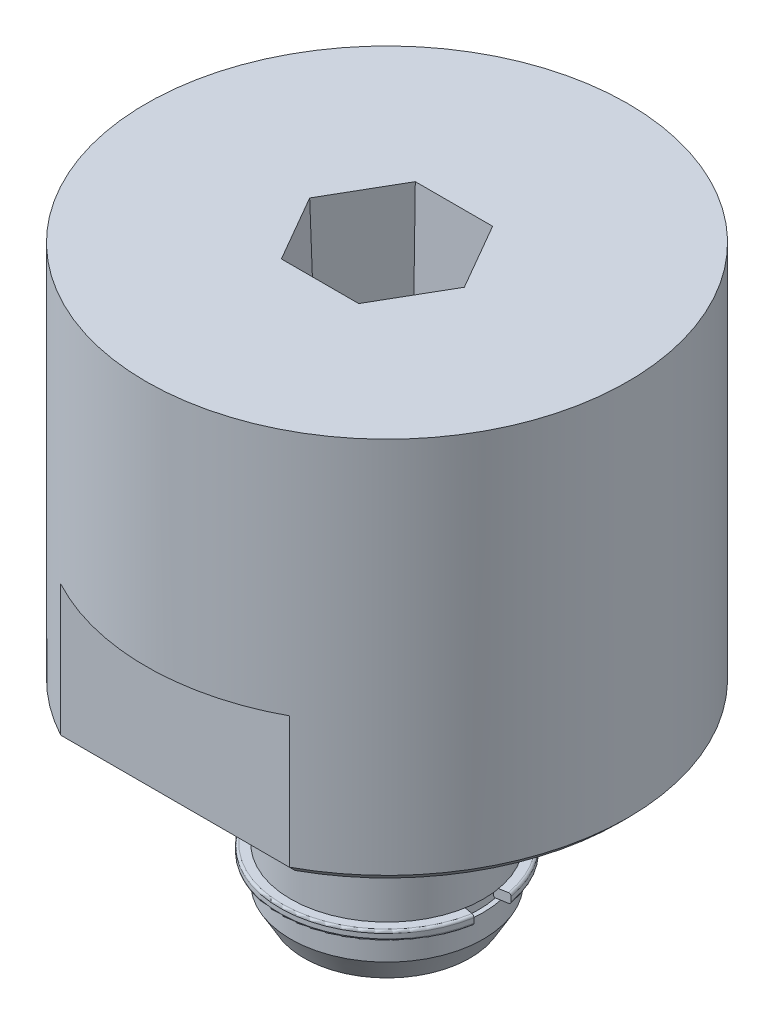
ISO-10303-21;
HEADER;
FILE_DESCRIPTION(('STEP AP214'),'2;1');
FILE_NAME('part.step','',(''),(''),'','','');
FILE_SCHEMA(('AUTOMOTIVE_DESIGN { 1 0 10303 214 1 1 1 1 }'));
ENDSEC;
DATA;
#1=APPLICATION_CONTEXT('core data for automotive mechanical design processes');
#2=APPLICATION_PROTOCOL_DEFINITION('international standard','automotive_design',2000,#1);
#3=PRODUCT_CONTEXT('',#1,'mechanical');
#4=PRODUCT('Part','Part','',(#3));
#5=PRODUCT_RELATED_PRODUCT_CATEGORY('part','',(#4));
#6=PRODUCT_DEFINITION_FORMATION('','',#4);
#7=PRODUCT_DEFINITION_CONTEXT('part definition',#1,'design');
#8=PRODUCT_DEFINITION('design','',#6,#7);
#9=PRODUCT_DEFINITION_SHAPE('','',#8);
#10=(LENGTH_UNIT() NAMED_UNIT(*) SI_UNIT(.MILLI.,.METRE.));
#11=(NAMED_UNIT(*) PLANE_ANGLE_UNIT() SI_UNIT($,.RADIAN.));
#12=(NAMED_UNIT(*) SI_UNIT($,.STERADIAN.) SOLID_ANGLE_UNIT());
#13=UNCERTAINTY_MEASURE_WITH_UNIT(LENGTH_MEASURE(1.E-05),#10,'distance_accuracy_value','');
#14=(GEOMETRIC_REPRESENTATION_CONTEXT(3) GLOBAL_UNCERTAINTY_ASSIGNED_CONTEXT((#13)) GLOBAL_UNIT_ASSIGNED_CONTEXT((#10,
#11,#12)) REPRESENTATION_CONTEXT('',''));
#15=CARTESIAN_POINT('',(0.,0.,0.));
#16=DIRECTION('',(0.,0.,1.));
#17=DIRECTION('',(1.,0.,0.));
#18=AXIS2_PLACEMENT_3D('',#15,#16,#17);
#19=CARTESIAN_POINT('',(0.,0.4826,0.));
#20=DIRECTION('',(0.,-1.,0.));
#21=DIRECTION('',(0.,0.,-1.));
#22=AXIS2_PLACEMENT_3D('',#19,#20,#21);
#23=CYLINDRICAL_SURFACE('',#22,3.0226);
#24=CARTESIAN_POINT('',(0.,1.6764,0.));
#25=DIRECTION('',(0.,-1.,0.));
#26=DIRECTION('',(0.984807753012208,0.,0.17364817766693));
#27=AXIS2_PLACEMENT_3D('',#24,#25,#26);
#28=CIRCLE('',#27,3.0226);
#29=CARTESIAN_POINT('',(2.9766799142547,1.6764,0.524868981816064));
#30=VERTEX_POINT('',#29);
#31=CARTESIAN_POINT('',(2.9766799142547,1.6764,-0.524868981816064));
#32=VERTEX_POINT('',#31);
#33=EDGE_CURVE('E125',#30,#32,#28,.T.);
#34=ORIENTED_EDGE('',*,*,#33,.T.);
#35=DIRECTION('',(0.,1.,0.));
#36=VECTOR('',#35,1.);
#37=CARTESIAN_POINT('',(2.9766799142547,1.6764,-0.524868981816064));
#38=LINE('',#37,#36);
#39=CARTESIAN_POINT('',(2.9766799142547,1.8288,-0.524868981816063));
#40=VERTEX_POINT('',#39);
#41=EDGE_CURVE('E116',#32,#40,#38,.T.);
#42=ORIENTED_EDGE('',*,*,#41,.T.);
#43=CARTESIAN_POINT('',(0.,1.8288,0.));
#44=DIRECTION('',(0.,-1.,0.));
#45=DIRECTION('',(0.984807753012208,0.,0.17364817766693));
#46=AXIS2_PLACEMENT_3D('',#43,#44,#45);
#47=CIRCLE('',#46,3.0226);
#48=CARTESIAN_POINT('',(2.9766799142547,1.8288,0.524868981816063));
#49=VERTEX_POINT('',#48);
#50=EDGE_CURVE('E124',#49,#40,#47,.T.);
#51=ORIENTED_EDGE('',*,*,#50,.F.);
#52=DIRECTION('',(0.,-1.,0.));
#53=VECTOR('',#52,1.);
#54=CARTESIAN_POINT('',(2.9766799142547,1.8288,0.524868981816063));
#55=LINE('',#54,#53);
#56=EDGE_CURVE('E137',#49,#30,#55,.T.);
#57=ORIENTED_EDGE('',*,*,#56,.T.);
#58=EDGE_LOOP('',(#34,#42,#51,#57));
#59=FACE_BOUND('',#58,.T.);
#60=ADVANCED_FACE('F54',(#59),#23,.F.);
#61=CARTESIAN_POINT('',(0.,1.67639999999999,0.));
#62=DIRECTION('',(0.,-1.,0.));
#63=DIRECTION('',(0.,0.,-1.));
#64=AXIS2_PLACEMENT_3D('',#61,#62,#63);
#65=TOROIDAL_SURFACE('',#64,3.0988,0.0761999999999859);
#66=CARTESIAN_POINT('',(0.,1.6002,0.));
#67=DIRECTION('',(0.,-1.,0.));
#68=DIRECTION('',(0.984807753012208,0.,0.173648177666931));
#69=AXIS2_PLACEMENT_3D('',#66,#67,#68);
#70=CIRCLE('',#69,3.0988);
#71=CARTESIAN_POINT('',(3.05172226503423,1.6002,0.538100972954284));
#72=VERTEX_POINT('',#71);
#73=CARTESIAN_POINT('',(3.05172226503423,1.6002,-0.538100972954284));
#74=VERTEX_POINT('',#73);
#75=EDGE_CURVE('E133',#72,#74,#70,.T.);
#76=ORIENTED_EDGE('',*,*,#75,.T.);
#77=CARTESIAN_POINT('',(3.05172226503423,1.67639999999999,-0.538100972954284));
#78=DIRECTION('',(-0.17364817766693,0.,-0.984807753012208));
#79=DIRECTION('',(0.,-1.,0.));
#80=AXIS2_PLACEMENT_3D('',#77,#78,#79);
#81=CIRCLE('',#80,0.0761999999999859);
#82=EDGE_CURVE('E118',#74,#32,#81,.T.);
#83=ORIENTED_EDGE('',*,*,#82,.T.);
#84=ORIENTED_EDGE('',*,*,#33,.F.);
#85=CARTESIAN_POINT('',(3.05172226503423,1.67639999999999,0.538100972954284));
#86=DIRECTION('',(-0.17364817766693,0.,0.984807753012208));
#87=DIRECTION('',(-0.984807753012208,0.,-0.17364817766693));
#88=AXIS2_PLACEMENT_3D('',#85,#86,#87);
#89=CIRCLE('',#88,0.0761999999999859);
#90=EDGE_CURVE('E134',#30,#72,#89,.T.);
#91=ORIENTED_EDGE('',*,*,#90,.T.);
#92=EDGE_LOOP('',(#76,#83,#84,#91));
#93=FACE_BOUND('',#92,.T.);
#94=ADVANCED_FACE('F130',(#93),#65,.T.);
#95=CARTESIAN_POINT('',(3.0988,1.6002,0.));
#96=DIRECTION('',(0.,-1.,0.));
#97=DIRECTION('',(0.,0.,-1.));
#98=AXIS2_PLACEMENT_3D('',#95,#96,#97);
#99=PLANE('',#98);
#100=CARTESIAN_POINT('',(0.,1.6002,0.));
#101=DIRECTION('',(0.,-1.,0.));
#102=DIRECTION('',(0.984807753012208,0.,0.17364817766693));
#103=AXIS2_PLACEMENT_3D('',#100,#101,#102);
#104=CIRCLE('',#103,3.45439999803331);
#105=CARTESIAN_POINT('',(3.40191990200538,1.6002,0.599850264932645));
#106=VERTEX_POINT('',#105);
#107=CARTESIAN_POINT('',(3.40191990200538,1.6002,-0.599850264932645));
#108=VERTEX_POINT('',#107);
#109=EDGE_CURVE('E156',#106,#108,#104,.T.);
#110=ORIENTED_EDGE('',*,*,#109,.T.);
#111=DIRECTION('',(-0.984807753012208,0.,0.17364817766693));
#112=VECTOR('',#111,1.);
#113=CARTESIAN_POINT('',(3.40191990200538,1.6002,-0.599850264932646));
#114=LINE('',#113,#112);
#115=EDGE_CURVE('E161',#108,#74,#114,.T.);
#116=ORIENTED_EDGE('',*,*,#115,.T.);
#117=ORIENTED_EDGE('',*,*,#75,.F.);
#118=DIRECTION('',(0.984807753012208,0.,0.17364817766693));
#119=VECTOR('',#118,1.);
#120=CARTESIAN_POINT('',(3.05172226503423,1.6002,0.538100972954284));
#121=LINE('',#120,#119);
#122=EDGE_CURVE('E165',#72,#106,#121,.T.);
#123=ORIENTED_EDGE('',*,*,#122,.T.);
#124=EDGE_LOOP('',(#110,#116,#117,#123));
#125=FACE_BOUND('',#124,.T.);
#126=ADVANCED_FACE('F248',(#125),#99,.T.);
#127=CARTESIAN_POINT('',(0.,1.67639999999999,0.));
#128=DIRECTION('',(0.,-1.,0.));
#129=DIRECTION('',(0.,0.,-1.));
#130=AXIS2_PLACEMENT_3D('',#127,#128,#129);
#131=TOROIDAL_SURFACE('',#130,3.4544,0.0761999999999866);
#132=CARTESIAN_POINT('',(0.,1.6764,0.));
#133=DIRECTION('',(0.,-1.,0.));
#134=DIRECTION('',(0.984807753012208,0.,0.17364817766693));
#135=AXIS2_PLACEMENT_3D('',#132,#133,#134);
#136=CIRCLE('',#135,3.5306);
#137=CARTESIAN_POINT('',(3.4769622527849,1.6764,0.613082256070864));
#138=VERTEX_POINT('',#137);
#139=CARTESIAN_POINT('',(3.4769622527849,1.6764,-0.613082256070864));
#140=VERTEX_POINT('',#139);
#141=EDGE_CURVE('E170',#138,#140,#136,.T.);
#142=ORIENTED_EDGE('',*,*,#141,.T.);
#143=CARTESIAN_POINT('',(3.40191990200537,1.67639999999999,-0.599850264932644));
#144=DIRECTION('',(-0.17364817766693,0.,-0.984807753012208));
#145=DIRECTION('',(0.984807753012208,0.,-0.17364817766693));
#146=AXIS2_PLACEMENT_3D('',#143,#144,#145);
#147=CIRCLE('',#146,0.0761999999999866);
#148=EDGE_CURVE('E175',#140,#108,#147,.T.);
#149=ORIENTED_EDGE('',*,*,#148,.T.);
#150=ORIENTED_EDGE('',*,*,#109,.F.);
#151=CARTESIAN_POINT('',(3.40191990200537,1.67639999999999,0.599850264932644));
#152=DIRECTION('',(-0.17364817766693,0.,0.984807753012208));
#153=DIRECTION('',(1.10880188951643E-13,-1.,0.));
#154=AXIS2_PLACEMENT_3D('',#151,#152,#153);
#155=CIRCLE('',#154,0.0761999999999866);
#156=EDGE_CURVE('E180',#106,#138,#155,.T.);
#157=ORIENTED_EDGE('',*,*,#156,.T.);
#158=EDGE_LOOP('',(#142,#149,#150,#157));
#159=FACE_BOUND('',#158,.T.);
#160=ADVANCED_FACE('F246',(#159),#131,.T.);
#161=CARTESIAN_POINT('',(0.,0.4826,0.));
#162=DIRECTION('',(0.,-1.,0.));
#163=DIRECTION('',(0.,0.,-1.));
#164=AXIS2_PLACEMENT_3D('',#161,#162,#163);
#165=CYLINDRICAL_SURFACE('',#164,3.5306);
#166=CARTESIAN_POINT('',(0.,1.8288,0.));
#167=DIRECTION('',(0.,-1.,0.));
#168=DIRECTION('',(0.984807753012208,0.,0.17364817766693));
#169=AXIS2_PLACEMENT_3D('',#166,#167,#168);
#170=CIRCLE('',#169,3.5306);
#171=CARTESIAN_POINT('',(3.4769622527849,1.8288,0.613082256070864));
#172=VERTEX_POINT('',#171);
#173=CARTESIAN_POINT('',(3.4769622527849,1.8288,-0.613082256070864));
#174=VERTEX_POINT('',#173);
#175=EDGE_CURVE('E185',#172,#174,#170,.T.);
#176=ORIENTED_EDGE('',*,*,#175,.T.);
#177=DIRECTION('',(0.,-1.,0.));
#178=VECTOR('',#177,1.);
#179=CARTESIAN_POINT('',(3.4769622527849,1.8288,-0.613082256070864));
#180=LINE('',#179,#178);
#181=EDGE_CURVE('E190',#174,#140,#180,.T.);
#182=ORIENTED_EDGE('',*,*,#181,.T.);
#183=ORIENTED_EDGE('',*,*,#141,.F.);
#184=DIRECTION('',(0.,1.,0.));
#185=VECTOR('',#184,1.);
#186=CARTESIAN_POINT('',(3.4769622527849,1.6764,0.613082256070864));
#187=LINE('',#186,#185);
#188=EDGE_CURVE('E195',#138,#172,#187,.T.);
#189=ORIENTED_EDGE('',*,*,#188,.T.);
#190=EDGE_LOOP('',(#176,#182,#183,#189));
#191=FACE_BOUND('',#190,.T.);
#192=ADVANCED_FACE('F242',(#191),#165,.T.);
#193=CARTESIAN_POINT('',(0.,1.82880000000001,0.));
#194=DIRECTION('',(0.,-1.,0.));
#195=DIRECTION('',(0.,0.,-1.));
#196=AXIS2_PLACEMENT_3D('',#193,#194,#195);
#197=TOROIDAL_SURFACE('',#196,3.4544,0.0761999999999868);
#198=CARTESIAN_POINT('',(0.,1.905,0.));
#199=DIRECTION('',(0.,-1.,0.));
#200=DIRECTION('',(0.984807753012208,0.,0.17364817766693));
#201=AXIS2_PLACEMENT_3D('',#198,#199,#200);
#202=CIRCLE('',#201,3.45439999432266);
#203=CARTESIAN_POINT('',(3.40191990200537,1.905,0.599850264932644));
#204=VERTEX_POINT('',#203);
#205=CARTESIAN_POINT('',(3.40191990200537,1.905,-0.599850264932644));
#206=VERTEX_POINT('',#205);
#207=EDGE_CURVE('E200',#204,#206,#202,.T.);
#208=ORIENTED_EDGE('',*,*,#207,.T.);
#209=CARTESIAN_POINT('',(3.40191990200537,1.82880000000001,-0.599850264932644));
#210=DIRECTION('',(-0.17364817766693,0.,-0.984807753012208));
#211=DIRECTION('',(0.,1.,0.));
#212=AXIS2_PLACEMENT_3D('',#209,#210,#211);
#213=CIRCLE('',#212,0.0761999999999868);
#214=EDGE_CURVE('E205',#206,#174,#213,.T.);
#215=ORIENTED_EDGE('',*,*,#214,.T.);
#216=ORIENTED_EDGE('',*,*,#175,.F.);
#217=CARTESIAN_POINT('',(3.40191990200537,1.82880000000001,0.599850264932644));
#218=DIRECTION('',(-0.17364817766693,0.,0.984807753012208));
#219=DIRECTION('',(0.984807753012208,-1.75931010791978E-13,0.17364817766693));
#220=AXIS2_PLACEMENT_3D('',#217,#218,#219);
#221=CIRCLE('',#220,0.0761999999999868);
#222=EDGE_CURVE('E210',#172,#204,#221,.T.);
#223=ORIENTED_EDGE('',*,*,#222,.T.);
#224=EDGE_LOOP('',(#208,#215,#216,#223));
#225=FACE_BOUND('',#224,.T.);
#226=ADVANCED_FACE('F240',(#225),#197,.T.);
#227=CARTESIAN_POINT('',(3.4544,1.905,0.));
#228=DIRECTION('',(0.,1.,0.));
#229=DIRECTION('',(0.,0.,1.));
#230=AXIS2_PLACEMENT_3D('',#227,#228,#229);
#231=PLANE('',#230);
#232=CARTESIAN_POINT('',(0.,1.905,0.));
#233=DIRECTION('',(0.,-1.,0.));
#234=DIRECTION('',(0.984807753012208,0.,0.17364817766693));
#235=AXIS2_PLACEMENT_3D('',#232,#233,#234);
#236=CIRCLE('',#235,3.09879999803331);
#237=CARTESIAN_POINT('',(3.05172226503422,1.905,0.538100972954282));
#238=VERTEX_POINT('',#237);
#239=CARTESIAN_POINT('',(3.05172226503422,1.905,-0.538100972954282));
#240=VERTEX_POINT('',#239);
#241=EDGE_CURVE('E215',#238,#240,#236,.T.);
#242=ORIENTED_EDGE('',*,*,#241,.T.);
#243=DIRECTION('',(0.984807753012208,0.,-0.173648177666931));
#244=VECTOR('',#243,1.);
#245=CARTESIAN_POINT('',(3.05172226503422,1.905,-0.538100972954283));
#246=LINE('',#245,#244);
#247=EDGE_CURVE('E76',#240,#206,#246,.T.);
#248=ORIENTED_EDGE('',*,*,#247,.T.);
#249=ORIENTED_EDGE('',*,*,#207,.F.);
#250=DIRECTION('',(-0.984807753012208,0.,-0.173648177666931));
#251=VECTOR('',#250,1.);
#252=CARTESIAN_POINT('',(3.40191990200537,1.905,0.599850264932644));
#253=LINE('',#252,#251);
#254=EDGE_CURVE('E223',#204,#238,#253,.T.);
#255=ORIENTED_EDGE('',*,*,#254,.T.);
#256=EDGE_LOOP('',(#242,#248,#249,#255));
#257=FACE_BOUND('',#256,.T.);
#258=ADVANCED_FACE('F235',(#257),#231,.T.);
#259=CARTESIAN_POINT('',(0.,1.82880000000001,0.));
#260=DIRECTION('',(0.,-1.,0.));
#261=DIRECTION('',(0.,0.,-1.));
#262=AXIS2_PLACEMENT_3D('',#259,#260,#261);
#263=TOROIDAL_SURFACE('',#262,3.0988,0.0761999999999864);
#264=ORIENTED_EDGE('',*,*,#50,.T.);
#265=CARTESIAN_POINT('',(3.05172226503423,1.82880000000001,-0.538100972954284));
#266=DIRECTION('',(-0.17364817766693,0.,-0.984807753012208));
#267=DIRECTION('',(-0.984807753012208,-1.78662858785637E-13,0.17364817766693));
#268=AXIS2_PLACEMENT_3D('',#265,#266,#267);
#269=CIRCLE('',#268,0.0761999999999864);
#270=EDGE_CURVE('E63',#40,#240,#269,.T.);
#271=ORIENTED_EDGE('',*,*,#270,.T.);
#272=ORIENTED_EDGE('',*,*,#241,.F.);
#273=CARTESIAN_POINT('',(3.05172226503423,1.82880000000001,0.538100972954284));
#274=DIRECTION('',(-0.17364817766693,0.,0.984807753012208));
#275=DIRECTION('',(0.,1.,0.));
#276=AXIS2_PLACEMENT_3D('',#273,#274,#275);
#277=CIRCLE('',#276,0.0761999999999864);
#278=EDGE_CURVE('E12',#238,#49,#277,.T.);
#279=ORIENTED_EDGE('',*,*,#278,.T.);
#280=EDGE_LOOP('',(#264,#271,#272,#279));
#281=FACE_BOUND('',#280,.T.);
#282=ADVANCED_FACE('F233',(#281),#263,.T.);
#283=CARTESIAN_POINT('',(0.,2.0574,0.));
#284=DIRECTION('',(0.17364817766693,0.,-0.984807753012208));
#285=DIRECTION('',(-0.984807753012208,0.,-0.17364817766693));
#286=AXIS2_PLACEMENT_3D('',#283,#284,#285);
#287=PLANE('',#286);
#288=ORIENTED_EDGE('',*,*,#278,.F.);
#289=ORIENTED_EDGE('',*,*,#254,.F.);
#290=ORIENTED_EDGE('',*,*,#222,.F.);
#291=ORIENTED_EDGE('',*,*,#188,.F.);
#292=ORIENTED_EDGE('',*,*,#156,.F.);
#293=ORIENTED_EDGE('',*,*,#122,.F.);
#294=ORIENTED_EDGE('',*,*,#90,.F.);
#295=ORIENTED_EDGE('',*,*,#56,.F.);
#296=EDGE_LOOP('',(#288,#289,#290,#291,#292,#293,#294,#295));
#297=FACE_BOUND('',#296,.T.);
#298=ADVANCED_FACE('F237',(#297),#287,.T.);
#299=CARTESIAN_POINT('',(3.54950319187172,2.0574,-0.6258731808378));
#300=DIRECTION('',(0.17364817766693,0.,0.984807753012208));
#301=DIRECTION('',(0.984807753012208,0.,-0.17364817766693));
#302=AXIS2_PLACEMENT_3D('',#299,#300,#301);
#303=PLANE('',#302);
#304=ORIENTED_EDGE('',*,*,#82,.F.);
#305=ORIENTED_EDGE('',*,*,#115,.F.);
#306=ORIENTED_EDGE('',*,*,#148,.F.);
#307=ORIENTED_EDGE('',*,*,#181,.F.);
#308=ORIENTED_EDGE('',*,*,#214,.F.);
#309=ORIENTED_EDGE('',*,*,#247,.F.);
#310=ORIENTED_EDGE('',*,*,#270,.F.);
#311=ORIENTED_EDGE('',*,*,#41,.F.);
#312=EDGE_LOOP('',(#304,#305,#306,#307,#308,#309,#310,#311));
#313=FACE_BOUND('',#312,.T.);
#314=ADVANCED_FACE('F56',(#313),#303,.T.);
#315=CLOSED_SHELL('',(#60,#94,#126,#160,#192,#226,#258,#282,#298,#314));
#316=MANIFOLD_SOLID_BREP('B2',#315);
#317=CARTESIAN_POINT('',(7.93496,19.05,0.));
#318=DIRECTION('',(0.,1.,0.));
#319=DIRECTION('',(0.,0.,1.));
#320=AXIS2_PLACEMENT_3D('',#317,#318,#319);
#321=PLANE('',#320);
#322=DIRECTION('',(0.5,0.,0.866025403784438));
#323=VECTOR('',#322,1.);
#324=CARTESIAN_POINT('',(3.89429759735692,19.05,2.33287752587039));
#325=LINE('',#324,#323);
#326=CARTESIAN_POINT('',(2.54741012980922,19.05,0.));
#327=VERTEX_POINT('',#326);
#328=CARTESIAN_POINT('',(1.27370506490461,19.05,-2.2061218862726));
#329=VERTEX_POINT('',#328);
#330=EDGE_CURVE('E515',#327,#329,#325,.F.);
#331=ORIENTED_EDGE('',*,*,#330,.F.);
#332=DIRECTION('',(-0.5,0.,0.866025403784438));
#333=VECTOR('',#332,1.);
#334=CARTESIAN_POINT('',(3.89429759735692,19.05,-2.33287752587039));
#335=LINE('',#334,#333);
#336=CARTESIAN_POINT('',(1.27370506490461,19.05,2.2061218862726));
#337=VERTEX_POINT('',#336);
#338=EDGE_CURVE('E426',#337,#327,#335,.F.);
#339=ORIENTED_EDGE('',*,*,#338,.F.);
#340=DIRECTION('',(-1.,0.,0.));
#341=VECTOR('',#340,1.);
#342=CARTESIAN_POINT('',(7.93496,19.05,2.2061218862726));
#343=LINE('',#342,#341);
#344=CARTESIAN_POINT('',(-1.27370506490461,19.05,2.2061218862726));
#345=VERTEX_POINT('',#344);
#346=EDGE_CURVE('E405',#345,#337,#343,.F.);
#347=ORIENTED_EDGE('',*,*,#346,.F.);
#348=DIRECTION('',(-0.5,0.,-0.866025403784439));
#349=VECTOR('',#348,1.);
#350=CARTESIAN_POINT('',(0.073182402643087,19.05,4.53899941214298));
#351=LINE('',#350,#349);
#352=CARTESIAN_POINT('',(-2.54741012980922,19.05,0.));
#353=VERTEX_POINT('',#352);
#354=EDGE_CURVE('E416',#353,#345,#351,.F.);
#355=ORIENTED_EDGE('',*,*,#354,.F.);
#356=DIRECTION('',(0.5,0.,-0.866025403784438));
#357=VECTOR('',#356,1.);
#358=CARTESIAN_POINT('',(0.0731824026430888,19.05,-4.53899941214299));
#359=LINE('',#358,#357);
#360=CARTESIAN_POINT('',(-1.27370506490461,19.05,-2.2061218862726));
#361=VERTEX_POINT('',#360);
#362=EDGE_CURVE('E422',#361,#353,#359,.F.);
#363=ORIENTED_EDGE('',*,*,#362,.F.);
#364=DIRECTION('',(1.,0.,0.));
#365=VECTOR('',#364,1.);
#366=CARTESIAN_POINT('',(7.93496,19.05,-2.2061218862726));
#367=LINE('',#366,#365);
#368=EDGE_CURVE('E513',#329,#361,#367,.F.);
#369=ORIENTED_EDGE('',*,*,#368,.F.);
#370=EDGE_LOOP('',(#331,#339,#347,#355,#363,#369));
#371=FACE_BOUND('',#370,.T.);
#372=CARTESIAN_POINT('',(0.,19.05,0.));
#373=DIRECTION('',(0.,-1.,0.));
#374=DIRECTION('',(0.,0.,-1.));
#375=AXIS2_PLACEMENT_3D('',#372,#373,#374);
#376=CIRCLE('',#375,7.93496);
#377=CARTESIAN_POINT('',(0.,19.05,-7.93496));
#378=VERTEX_POINT('',#377);
#379=EDGE_CURVE('E586',#378,#378,#376,.T.);
#380=ORIENTED_EDGE('',*,*,#379,.F.);
#381=EDGE_LOOP('',(#380));
#382=FACE_BOUND('',#381,.T.);
#383=ADVANCED_FACE('F350',(#371,#382),#321,.T.);
#384=CARTESIAN_POINT('',(0.,0.,0.));
#385=DIRECTION('',(0.,-1.,0.));
#386=DIRECTION('',(0.,0.,-1.));
#387=AXIS2_PLACEMENT_3D('',#384,#385,#386);
#388=CYLINDRICAL_SURFACE('',#387,7.93496);
#389=DIRECTION('',(0.,-1.,0.));
#390=VECTOR('',#389,1.);
#391=CARTESIAN_POINT('',(-3.76475300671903,10.922,-6.985));
#392=LINE('',#391,#390);
#393=CARTESIAN_POINT('',(-3.76475300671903,10.922,-6.985));
#394=VERTEX_POINT('',#393);
#395=CARTESIAN_POINT('',(-3.76475300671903,6.604,-6.985));
#396=VERTEX_POINT('',#395);
#397=EDGE_CURVE('E546',#394,#396,#392,.T.);
#398=ORIENTED_EDGE('',*,*,#397,.T.);
#399=CARTESIAN_POINT('',(0.,6.604,0.));
#400=DIRECTION('',(0.,-1.,0.));
#401=DIRECTION('',(0.,0.,-1.));
#402=AXIS2_PLACEMENT_3D('',#399,#400,#401);
#403=CIRCLE('',#402,7.93496);
#404=CARTESIAN_POINT('',(-3.76475300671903,6.604,6.985));
#405=VERTEX_POINT('',#404);
#406=EDGE_CURVE('E368',#396,#405,#403,.F.);
#407=ORIENTED_EDGE('',*,*,#406,.T.);
#408=DIRECTION('',(0.,-1.,0.));
#409=VECTOR('',#408,1.);
#410=CARTESIAN_POINT('',(-3.76475300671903,10.922,6.985));
#411=LINE('',#410,#409);
#412=CARTESIAN_POINT('',(-3.76475300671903,10.922,6.985));
#413=VERTEX_POINT('',#412);
#414=EDGE_CURVE('E549',#413,#405,#411,.T.);
#415=ORIENTED_EDGE('',*,*,#414,.F.);
#416=CARTESIAN_POINT('',(0.,10.922,0.));
#417=DIRECTION('',(0.,-1.,0.));
#418=DIRECTION('',(0.,0.,-1.));
#419=AXIS2_PLACEMENT_3D('',#416,#417,#418);
#420=CIRCLE('',#419,7.93496);
#421=CARTESIAN_POINT('',(3.76475300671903,10.922,6.985));
#422=VERTEX_POINT('',#421);
#423=EDGE_CURVE('E542',#422,#413,#420,.T.);
#424=ORIENTED_EDGE('',*,*,#423,.F.);
#425=DIRECTION('',(0.,-1.,0.));
#426=VECTOR('',#425,1.);
#427=CARTESIAN_POINT('',(3.76475300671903,10.922,6.985));
#428=LINE('',#427,#426);
#429=CARTESIAN_POINT('',(3.76475300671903,6.604,6.985));
#430=VERTEX_POINT('',#429);
#431=EDGE_CURVE('E550',#422,#430,#428,.T.);
#432=ORIENTED_EDGE('',*,*,#431,.T.);
#433=CARTESIAN_POINT('',(0.,6.604,0.));
#434=DIRECTION('',(0.,-1.,0.));
#435=DIRECTION('',(0.,0.,-1.));
#436=AXIS2_PLACEMENT_3D('',#433,#434,#435);
#437=CIRCLE('',#436,7.93496);
#438=CARTESIAN_POINT('',(3.76475300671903,6.604,-6.985));
#439=VERTEX_POINT('',#438);
#440=EDGE_CURVE('E440',#430,#439,#437,.F.);
#441=ORIENTED_EDGE('',*,*,#440,.T.);
#442=DIRECTION('',(0.,-1.,0.));
#443=VECTOR('',#442,1.);
#444=CARTESIAN_POINT('',(3.76475300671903,10.922,-6.985));
#445=LINE('',#444,#443);
#446=CARTESIAN_POINT('',(3.76475300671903,10.922,-6.985));
#447=VERTEX_POINT('',#446);
#448=EDGE_CURVE('E559',#447,#439,#445,.T.);
#449=ORIENTED_EDGE('',*,*,#448,.F.);
#450=CARTESIAN_POINT('',(0.,10.922,0.));
#451=DIRECTION('',(0.,-1.,0.));
#452=DIRECTION('',(0.,0.,-1.));
#453=AXIS2_PLACEMENT_3D('',#450,#451,#452);
#454=CIRCLE('',#453,7.93496);
#455=EDGE_CURVE('E510',#394,#447,#454,.T.);
#456=ORIENTED_EDGE('',*,*,#455,.F.);
#457=EDGE_LOOP('',(#398,#407,#415,#424,#432,#441,#449,#456));
#458=FACE_BOUND('',#457,.T.);
#459=ORIENTED_EDGE('',*,*,#379,.T.);
#460=EDGE_LOOP('',(#459));
#461=FACE_BOUND('',#460,.T.);
#462=ADVANCED_FACE('F607',(#458,#461),#388,.T.);
#463=CARTESIAN_POINT('',(3.683,6.35,0.));
#464=DIRECTION('',(0.,-1.,0.));
#465=DIRECTION('',(0.,0.,-1.));
#466=AXIS2_PLACEMENT_3D('',#463,#464,#465);
#467=PLANE('',#466);
#468=CARTESIAN_POINT('',(0.,6.35,0.));
#469=DIRECTION('',(0.,-1.,0.));
#470=DIRECTION('',(0.,0.,-1.));
#471=AXIS2_PLACEMENT_3D('',#468,#469,#470);
#472=CIRCLE('',#471,7.68096);
#473=CARTESIAN_POINT('',(-3.70010615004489,6.35,6.731));
#474=VERTEX_POINT('',#473);
#475=CARTESIAN_POINT('',(-3.70010615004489,6.35,-6.731));
#476=VERTEX_POINT('',#475);
#477=EDGE_CURVE('E598',#474,#476,#472,.T.);
#478=ORIENTED_EDGE('',*,*,#477,.T.);
#479=DIRECTION('',(1.,0.,0.));
#480=VECTOR('',#479,1.);
#481=CARTESIAN_POINT('',(3.76475300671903,6.35,-6.731));
#482=LINE('',#481,#480);
#483=CARTESIAN_POINT('',(3.70010615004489,6.35,-6.731));
#484=VERTEX_POINT('',#483);
#485=EDGE_CURVE('E601',#476,#484,#482,.T.);
#486=ORIENTED_EDGE('',*,*,#485,.T.);
#487=CARTESIAN_POINT('',(0.,6.35,0.));
#488=DIRECTION('',(0.,-1.,0.));
#489=DIRECTION('',(0.,0.,-1.));
#490=AXIS2_PLACEMENT_3D('',#487,#488,#489);
#491=CIRCLE('',#490,7.68096);
#492=CARTESIAN_POINT('',(3.70010615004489,6.35,6.731));
#493=VERTEX_POINT('',#492);
#494=EDGE_CURVE('E592',#484,#493,#491,.T.);
#495=ORIENTED_EDGE('',*,*,#494,.T.);
#496=DIRECTION('',(-1.,0.,0.));
#497=VECTOR('',#496,1.);
#498=CARTESIAN_POINT('',(-3.76475300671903,6.35,6.731));
#499=LINE('',#498,#497);
#500=EDGE_CURVE('E595',#493,#474,#499,.T.);
#501=ORIENTED_EDGE('',*,*,#500,.T.);
#502=EDGE_LOOP('',(#478,#486,#495,#501));
#503=FACE_BOUND('',#502,.T.);
#504=CARTESIAN_POINT('',(0.,6.35,-5.715));
#505=DIRECTION('',(0.,-1.,0.));
#506=DIRECTION('',(-0.707106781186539,0.,-0.707106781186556));
#507=AXIS2_PLACEMENT_3D('',#504,#505,#506);
#508=CIRCLE('',#507,0.567961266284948);
#509=CARTESIAN_POINT('',(-0.40160926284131,6.35,-6.11660926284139));
#510=VERTEX_POINT('',#509);
#511=EDGE_CURVE('E494',#510,#510,#508,.T.);
#512=ORIENTED_EDGE('',*,*,#511,.F.);
#513=EDGE_LOOP('',(#512));
#514=FACE_BOUND('',#513,.T.);
#515=CARTESIAN_POINT('',(-4.04111525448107,6.35,-4.04111525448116));
#516=DIRECTION('',(0.,-1.,0.));
#517=DIRECTION('',(-1.,0.,0.));
#518=AXIS2_PLACEMENT_3D('',#515,#516,#517);
#519=CIRCLE('',#518,0.567961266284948);
#520=CARTESIAN_POINT('',(-4.60907652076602,6.35,-4.04111525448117));
#521=VERTEX_POINT('',#520);
#522=EDGE_CURVE('E776',#521,#521,#519,.T.);
#523=ORIENTED_EDGE('',*,*,#522,.F.);
#524=EDGE_LOOP('',(#523));
#525=FACE_BOUND('',#524,.T.);
#526=CARTESIAN_POINT('',(-5.715,6.35,0.));
#527=DIRECTION('',(0.,-1.,0.));
#528=DIRECTION('',(-0.707106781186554,0.,0.707106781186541));
#529=AXIS2_PLACEMENT_3D('',#526,#527,#528);
#530=CIRCLE('',#529,0.567961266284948);
#531=CARTESIAN_POINT('',(-6.11660926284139,6.35,0.401609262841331));
#532=VERTEX_POINT('',#531);
#533=EDGE_CURVE('E779',#532,#532,#530,.T.);
#534=ORIENTED_EDGE('',*,*,#533,.F.);
#535=EDGE_LOOP('',(#534));
#536=FACE_BOUND('',#535,.T.);
#537=CARTESIAN_POINT('',(-4.04111525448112,6.35,4.04111525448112));
#538=DIRECTION('',(0.,-1.,0.));
#539=DIRECTION('',(0.,0.,1.));
#540=AXIS2_PLACEMENT_3D('',#537,#538,#539);
#541=CIRCLE('',#540,0.567961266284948);
#542=CARTESIAN_POINT('',(-4.04111525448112,6.35,4.60907652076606));
#543=VERTEX_POINT('',#542);
#544=EDGE_CURVE('E782',#543,#543,#541,.T.);
#545=ORIENTED_EDGE('',*,*,#544,.F.);
#546=EDGE_LOOP('',(#545));
#547=FACE_BOUND('',#546,.T.);
#548=CARTESIAN_POINT('',(0.,6.35,5.715));
#549=DIRECTION('',(0.,-1.,0.));
#550=DIRECTION('',(0.707106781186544,0.,0.707106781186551));
#551=AXIS2_PLACEMENT_3D('',#548,#549,#550);
#552=CIRCLE('',#551,0.567961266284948);
#553=CARTESIAN_POINT('',(0.401609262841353,6.35,6.11660926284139));
#554=VERTEX_POINT('',#553);
#555=EDGE_CURVE('E785',#554,#554,#552,.T.);
#556=ORIENTED_EDGE('',*,*,#555,.F.);
#557=EDGE_LOOP('',(#556));
#558=FACE_BOUND('',#557,.T.);
#559=CARTESIAN_POINT('',(4.0411152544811,6.35,4.04111525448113));
#560=DIRECTION('',(0.,-1.,0.));
#561=DIRECTION('',(1.,0.,0.));
#562=AXIS2_PLACEMENT_3D('',#559,#560,#561);
#563=CIRCLE('',#562,0.567961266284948);
#564=CARTESIAN_POINT('',(4.60907652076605,6.35,4.04111525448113));
#565=VERTEX_POINT('',#564);
#566=EDGE_CURVE('E525',#565,#565,#563,.T.);
#567=ORIENTED_EDGE('',*,*,#566,.F.);
#568=EDGE_LOOP('',(#567));
#569=FACE_BOUND('',#568,.T.);
#570=CARTESIAN_POINT('',(5.715,6.35,0.));
#571=DIRECTION('',(0.,-1.,0.));
#572=DIRECTION('',(0.707106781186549,0.,-0.707106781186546));
#573=AXIS2_PLACEMENT_3D('',#570,#571,#572);
#574=CIRCLE('',#573,0.567961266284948);
#575=CARTESIAN_POINT('',(6.11660926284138,6.35,-0.401609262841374));
#576=VERTEX_POINT('',#575);
#577=EDGE_CURVE('E520',#576,#576,#574,.T.);
#578=ORIENTED_EDGE('',*,*,#577,.F.);
#579=EDGE_LOOP('',(#578));
#580=FACE_BOUND('',#579,.T.);
#581=CARTESIAN_POINT('',(4.04111525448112,6.35,-4.04111525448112));
#582=DIRECTION('',(0.,-1.,0.));
#583=DIRECTION('',(0.,0.,-1.));
#584=AXIS2_PLACEMENT_3D('',#581,#582,#583);
#585=CIRCLE('',#584,0.567961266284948);
#586=CARTESIAN_POINT('',(4.04111525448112,6.35,-4.60907652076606));
#587=VERTEX_POINT('',#586);
#588=EDGE_CURVE('E516',#587,#587,#585,.T.);
#589=ORIENTED_EDGE('',*,*,#588,.F.);
#590=EDGE_LOOP('',(#589));
#591=FACE_BOUND('',#590,.T.);
#592=CARTESIAN_POINT('',(0.,6.35,0.));
#593=DIRECTION('',(0.,-1.,0.));
#594=DIRECTION('',(0.,0.,-1.));
#595=AXIS2_PLACEMENT_3D('',#592,#593,#594);
#596=CIRCLE('',#595,3.683);
#597=CARTESIAN_POINT('',(0.,6.35,-3.683));
#598=VERTEX_POINT('',#597);
#599=EDGE_CURVE('E583',#598,#598,#596,.T.);
#600=ORIENTED_EDGE('',*,*,#599,.F.);
#601=EDGE_LOOP('',(#600));
#602=FACE_BOUND('',#601,.T.);
#603=ADVANCED_FACE('F679',(#503,#514,#525,#536,#547,#558,#569,#580,#591,#602),#467,.T.);
#604=CARTESIAN_POINT('',(0.,5.842,0.));
#605=DIRECTION('',(0.,-1.,0.));
#606=DIRECTION('',(0.,0.,-1.));
#607=AXIS2_PLACEMENT_3D('',#604,#605,#606);
#608=TOROIDAL_SURFACE('',#607,3.683,0.508);
#609=ORIENTED_EDGE('',*,*,#599,.T.);
#610=EDGE_LOOP('',(#609));
#611=FACE_BOUND('',#610,.T.);
#612=CARTESIAN_POINT('',(0.,5.842,0.));
#613=DIRECTION('',(0.,-1.,0.));
#614=DIRECTION('',(0.,0.,-1.));
#615=AXIS2_PLACEMENT_3D('',#612,#613,#614);
#616=CIRCLE('',#615,3.175);
#617=CARTESIAN_POINT('',(0.,5.842,-3.175));
#618=VERTEX_POINT('',#617);
#619=EDGE_CURVE('E580',#618,#618,#616,.T.);
#620=ORIENTED_EDGE('',*,*,#619,.F.);
#621=EDGE_LOOP('',(#620));
#622=FACE_BOUND('',#621,.T.);
#623=ADVANCED_FACE('F684',(#611,#622),#608,.F.);
#624=CARTESIAN_POINT('',(0.,0.,0.));
#625=DIRECTION('',(0.,-1.,0.));
#626=DIRECTION('',(0.,0.,-1.));
#627=AXIS2_PLACEMENT_3D('',#624,#625,#626);
#628=CYLINDRICAL_SURFACE('',#627,3.175);
#629=ORIENTED_EDGE('',*,*,#619,.T.);
#630=EDGE_LOOP('',(#629));
#631=FACE_BOUND('',#630,.T.);
#632=CARTESIAN_POINT('',(0.,1.905,0.));
#633=DIRECTION('',(0.,-1.,0.));
#634=DIRECTION('',(0.,0.,-1.));
#635=AXIS2_PLACEMENT_3D('',#632,#633,#634);
#636=CIRCLE('',#635,3.175);
#637=CARTESIAN_POINT('',(0.,1.905,-3.175));
#638=VERTEX_POINT('',#637);
#639=EDGE_CURVE('E577',#638,#638,#636,.T.);
#640=ORIENTED_EDGE('',*,*,#639,.F.);
#641=EDGE_LOOP('',(#640));
#642=FACE_BOUND('',#641,.T.);
#643=ADVANCED_FACE('F687',(#631,#642),#628,.T.);
#644=CARTESIAN_POINT('',(3.175,1.905,0.));
#645=DIRECTION('',(0.,-1.,0.));
#646=DIRECTION('',(0.,0.,-1.));
#647=AXIS2_PLACEMENT_3D('',#644,#645,#646);
#648=PLANE('',#647);
#649=ORIENTED_EDGE('',*,*,#639,.T.);
#650=EDGE_LOOP('',(#649));
#651=FACE_BOUND('',#650,.T.);
#652=CARTESIAN_POINT('',(0.,1.905,0.));
#653=DIRECTION('',(0.,-1.,0.));
#654=DIRECTION('',(0.,0.,-1.));
#655=AXIS2_PLACEMENT_3D('',#652,#653,#654);
#656=CIRCLE('',#655,3.0226);
#657=CARTESIAN_POINT('',(0.,1.905,-3.0226));
#658=VERTEX_POINT('',#657);
#659=EDGE_CURVE('E574',#658,#658,#656,.T.);
#660=ORIENTED_EDGE('',*,*,#659,.F.);
#661=EDGE_LOOP('',(#660));
#662=FACE_BOUND('',#661,.T.);
#663=ADVANCED_FACE('F691',(#651,#662),#648,.T.);
#664=CARTESIAN_POINT('',(0.,0.,0.));
#665=DIRECTION('',(0.,-1.,0.));
#666=DIRECTION('',(0.,0.,-1.));
#667=AXIS2_PLACEMENT_3D('',#664,#665,#666);
#668=CYLINDRICAL_SURFACE('',#667,3.0226);
#669=ORIENTED_EDGE('',*,*,#659,.T.);
#670=EDGE_LOOP('',(#669));
#671=FACE_BOUND('',#670,.T.);
#672=CARTESIAN_POINT('',(0.,1.524,0.));
#673=DIRECTION('',(0.,-1.,0.));
#674=DIRECTION('',(0.,0.,-1.));
#675=AXIS2_PLACEMENT_3D('',#672,#673,#674);
#676=CIRCLE('',#675,3.0226);
#677=CARTESIAN_POINT('',(0.,1.524,-3.0226));
#678=VERTEX_POINT('',#677);
#679=EDGE_CURVE('E571',#678,#678,#676,.T.);
#680=ORIENTED_EDGE('',*,*,#679,.F.);
#681=EDGE_LOOP('',(#680));
#682=FACE_BOUND('',#681,.T.);
#683=ADVANCED_FACE('F695',(#671,#682),#668,.T.);
#684=CARTESIAN_POINT('',(3.0226,1.524,0.));
#685=DIRECTION('',(0.,1.,0.));
#686=DIRECTION('',(0.,0.,1.));
#687=AXIS2_PLACEMENT_3D('',#684,#685,#686);
#688=PLANE('',#687);
#689=ORIENTED_EDGE('',*,*,#679,.T.);
#690=EDGE_LOOP('',(#689));
#691=FACE_BOUND('',#690,.T.);
#692=CARTESIAN_POINT('',(0.,1.524,0.));
#693=DIRECTION('',(0.,-1.,0.));
#694=DIRECTION('',(0.,0.,-1.));
#695=AXIS2_PLACEMENT_3D('',#692,#693,#694);
#696=CIRCLE('',#695,3.175);
#697=CARTESIAN_POINT('',(0.,1.524,-3.175));
#698=VERTEX_POINT('',#697);
#699=EDGE_CURVE('E568',#698,#698,#696,.T.);
#700=ORIENTED_EDGE('',*,*,#699,.F.);
#701=EDGE_LOOP('',(#700));
#702=FACE_BOUND('',#701,.T.);
#703=ADVANCED_FACE('F699',(#691,#702),#688,.T.);
#704=CARTESIAN_POINT('',(0.,0.,0.));
#705=DIRECTION('',(0.,-1.,0.));
#706=DIRECTION('',(0.,0.,-1.));
#707=AXIS2_PLACEMENT_3D('',#704,#705,#706);
#708=CYLINDRICAL_SURFACE('',#707,3.175);
#709=ORIENTED_EDGE('',*,*,#699,.T.);
#710=EDGE_LOOP('',(#709));
#711=FACE_BOUND('',#710,.T.);
#712=CARTESIAN_POINT('',(0.,0.762,0.));
#713=DIRECTION('',(0.,-1.,0.));
#714=DIRECTION('',(0.,0.,-1.));
#715=AXIS2_PLACEMENT_3D('',#712,#713,#714);
#716=CIRCLE('',#715,3.175);
#717=CARTESIAN_POINT('',(0.,0.762,-3.175));
#718=VERTEX_POINT('',#717);
#719=EDGE_CURVE('E565',#718,#718,#716,.T.);
#720=ORIENTED_EDGE('',*,*,#719,.F.);
#721=EDGE_LOOP('',(#720));
#722=FACE_BOUND('',#721,.T.);
#723=ADVANCED_FACE('F703',(#711,#722),#708,.T.);
#724=CARTESIAN_POINT('',(0.,0.,0.));
#725=DIRECTION('',(0.,1.,0.));
#726=DIRECTION('',(0.,0.,1.));
#727=AXIS2_PLACEMENT_3D('',#724,#725,#726);
#728=CONICAL_SURFACE('',#727,2.73505909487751,0.523598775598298);
#729=ORIENTED_EDGE('',*,*,#719,.T.);
#730=EDGE_LOOP('',(#729));
#731=FACE_BOUND('',#730,.T.);
#732=CARTESIAN_POINT('',(0.,0.,0.));
#733=DIRECTION('',(0.,-1.,0.));
#734=DIRECTION('',(0.,0.,-1.));
#735=AXIS2_PLACEMENT_3D('',#732,#733,#734);
#736=CIRCLE('',#735,2.73505909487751);
#737=CARTESIAN_POINT('',(0.,0.,-2.73505909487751));
#738=VERTEX_POINT('',#737);
#739=EDGE_CURVE('E552',#738,#738,#736,.T.);
#740=ORIENTED_EDGE('',*,*,#739,.F.);
#741=EDGE_LOOP('',(#740));
#742=FACE_BOUND('',#741,.T.);
#743=ADVANCED_FACE('F707',(#731,#742),#728,.T.);
#744=CARTESIAN_POINT('',(0.,0.,0.));
#745=DIRECTION('',(0.,-1.,0.));
#746=DIRECTION('',(0.,0.,-1.));
#747=AXIS2_PLACEMENT_3D('',#744,#745,#746);
#748=PLANE('',#747);
#749=CARTESIAN_POINT('',(0.,0.,0.));
#750=DIRECTION('',(0.,-1.,0.));
#751=DIRECTION('',(0.,0.,-1.));
#752=AXIS2_PLACEMENT_3D('',#749,#750,#751);
#753=CIRCLE('',#752,2.0955);
#754=CARTESIAN_POINT('',(0.,0.,-2.0955));
#755=VERTEX_POINT('',#754);
#756=EDGE_CURVE('E360',#755,#755,#753,.F.);
#757=ORIENTED_EDGE('',*,*,#756,.T.);
#758=EDGE_LOOP('',(#757));
#759=FACE_BOUND('',#758,.T.);
#760=ORIENTED_EDGE('',*,*,#739,.T.);
#761=EDGE_LOOP('',(#760));
#762=FACE_BOUND('',#761,.T.);
#763=ADVANCED_FACE('F711',(#759,#762),#748,.T.);
#764=CARTESIAN_POINT('',(-3.76475300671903,10.922,-6.985));
#765=DIRECTION('',(0.,0.,1.));
#766=DIRECTION('',(1.,0.,0.));
#767=AXIS2_PLACEMENT_3D('',#764,#765,#766);
#768=PLANE('',#767);
#769=ORIENTED_EDGE('',*,*,#448,.T.);
#770=DIRECTION('',(-1.,0.,0.));
#771=VECTOR('',#770,1.);
#772=CARTESIAN_POINT('',(-3.76475300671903,6.604,-6.985));
#773=LINE('',#772,#771);
#774=EDGE_CURVE('E589',#439,#396,#773,.T.);
#775=ORIENTED_EDGE('',*,*,#774,.T.);
#776=ORIENTED_EDGE('',*,*,#397,.F.);
#777=DIRECTION('',(-1.,0.,0.));
#778=VECTOR('',#777,1.);
#779=CARTESIAN_POINT('',(-3.76475300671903,10.922,-6.985));
#780=LINE('',#779,#778);
#781=EDGE_CURVE('E556',#447,#394,#780,.T.);
#782=ORIENTED_EDGE('',*,*,#781,.F.);
#783=EDGE_LOOP('',(#769,#775,#776,#782));
#784=FACE_BOUND('',#783,.T.);
#785=ADVANCED_FACE('F618',(#784),#768,.F.);
#786=CARTESIAN_POINT('',(0.,10.922,0.));
#787=DIRECTION('',(0.,-1.,0.));
#788=DIRECTION('',(0.,0.,-1.));
#789=AXIS2_PLACEMENT_3D('',#786,#787,#788);
#790=PLANE('',#789);
#791=ORIENTED_EDGE('',*,*,#455,.T.);
#792=ORIENTED_EDGE('',*,*,#781,.T.);
#793=EDGE_LOOP('',(#791,#792));
#794=FACE_BOUND('',#793,.T.);
#795=ADVANCED_FACE('F717',(#794),#790,.T.);
#796=CARTESIAN_POINT('',(-3.76475300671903,10.922,6.985));
#797=DIRECTION('',(0.,0.,-1.));
#798=DIRECTION('',(-1.,0.,0.));
#799=AXIS2_PLACEMENT_3D('',#796,#797,#798);
#800=PLANE('',#799);
#801=ORIENTED_EDGE('',*,*,#414,.T.);
#802=DIRECTION('',(1.,0.,0.));
#803=VECTOR('',#802,1.);
#804=CARTESIAN_POINT('',(3.76475300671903,6.604,6.985));
#805=LINE('',#804,#803);
#806=EDGE_CURVE('E432',#405,#430,#805,.T.);
#807=ORIENTED_EDGE('',*,*,#806,.T.);
#808=ORIENTED_EDGE('',*,*,#431,.F.);
#809=DIRECTION('',(1.,0.,0.));
#810=VECTOR('',#809,1.);
#811=CARTESIAN_POINT('',(-3.76475300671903,10.922,6.985));
#812=LINE('',#811,#810);
#813=EDGE_CURVE('E545',#413,#422,#812,.T.);
#814=ORIENTED_EDGE('',*,*,#813,.F.);
#815=EDGE_LOOP('',(#801,#807,#808,#814));
#816=FACE_BOUND('',#815,.T.);
#817=ADVANCED_FACE('F720',(#816),#800,.F.);
#818=CARTESIAN_POINT('',(0.,10.922,0.));
#819=DIRECTION('',(0.,-1.,0.));
#820=DIRECTION('',(0.,0.,-1.));
#821=AXIS2_PLACEMENT_3D('',#818,#819,#820);
#822=PLANE('',#821);
#823=ORIENTED_EDGE('',*,*,#423,.T.);
#824=ORIENTED_EDGE('',*,*,#813,.T.);
#825=EDGE_LOOP('',(#823,#824));
#826=FACE_BOUND('',#825,.T.);
#827=ADVANCED_FACE('F724',(#826),#822,.T.);
#828=CARTESIAN_POINT('',(2.29135888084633,12.7,0.));
#829=DIRECTION('',(-0.865497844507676,0.034899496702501,0.499695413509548));
#830=DIRECTION('',(0.5,0.,0.866025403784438));
#831=AXIS2_PLACEMENT_3D('',#828,#829,#830);
#832=PLANE('',#831);
#833=ORIENTED_EDGE('',*,*,#330,.T.);
#834=DIRECTION('',(0.0201451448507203,0.999188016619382,-0.0348924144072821));
#835=VECTOR('',#834,1.);
#836=CARTESIAN_POINT('',(1.144749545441,12.6538777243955,-1.98276437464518));
#837=LINE('',#836,#835);
#838=CARTESIAN_POINT('',(1.14567944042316,12.7,-1.984375));
#839=VERTEX_POINT('',#838);
#840=EDGE_CURVE('E504',#839,#329,#837,.T.);
#841=ORIENTED_EDGE('',*,*,#840,.F.);
#842=DIRECTION('',(-0.5,0.,-0.866025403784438));
#843=VECTOR('',#842,1.);
#844=CARTESIAN_POINT('',(2.29135888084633,12.7,0.));
#845=LINE('',#844,#843);
#846=CARTESIAN_POINT('',(2.29135888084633,12.7,0.));
#847=VERTEX_POINT('',#846);
#848=EDGE_CURVE('E428',#847,#839,#845,.T.);
#849=ORIENTED_EDGE('',*,*,#848,.F.);
#850=DIRECTION('',(0.0402902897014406,0.999188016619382,0.));
#851=VECTOR('',#850,1.);
#852=CARTESIAN_POINT('',(2.28949909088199,12.6538777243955,0.));
#853=LINE('',#852,#851);
#854=EDGE_CURVE('E508',#847,#327,#853,.T.);
#855=ORIENTED_EDGE('',*,*,#854,.T.);
#856=EDGE_LOOP('',(#833,#841,#849,#855));
#857=FACE_BOUND('',#856,.T.);
#858=ADVANCED_FACE('F658',(#857),#832,.T.);
#859=CARTESIAN_POINT('',(1.14567944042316,12.7,1.984375));
#860=DIRECTION('',(-0.865497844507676,0.034899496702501,-0.499695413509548));
#861=DIRECTION('',(-0.5,0.,0.866025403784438));
#862=AXIS2_PLACEMENT_3D('',#859,#860,#861);
#863=PLANE('',#862);
#864=ORIENTED_EDGE('',*,*,#338,.T.);
#865=ORIENTED_EDGE('',*,*,#854,.F.);
#866=DIRECTION('',(0.5,0.,-0.866025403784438));
#867=VECTOR('',#866,1.);
#868=CARTESIAN_POINT('',(1.14567944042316,12.7,1.984375));
#869=LINE('',#868,#867);
#870=CARTESIAN_POINT('',(1.14567944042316,12.7,1.984375));
#871=VERTEX_POINT('',#870);
#872=EDGE_CURVE('E507',#871,#847,#869,.T.);
#873=ORIENTED_EDGE('',*,*,#872,.F.);
#874=DIRECTION('',(0.0201451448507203,0.999188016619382,0.0348924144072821));
#875=VECTOR('',#874,1.);
#876=CARTESIAN_POINT('',(1.144749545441,12.6538777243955,1.98276437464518));
#877=LINE('',#876,#875);
#878=EDGE_CURVE('E395',#871,#337,#877,.T.);
#879=ORIENTED_EDGE('',*,*,#878,.T.);
#880=EDGE_LOOP('',(#864,#865,#873,#879));
#881=FACE_BOUND('',#880,.T.);
#882=ADVANCED_FACE('F665',(#881),#863,.T.);
#883=CARTESIAN_POINT('',(-1.14567944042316,12.7,1.984375));
#884=DIRECTION('',(0.,0.034899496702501,-0.999390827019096));
#885=DIRECTION('',(0.,0.999390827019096,0.034899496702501));
#886=AXIS2_PLACEMENT_3D('',#883,#884,#885);
#887=PLANE('',#886);
#888=ORIENTED_EDGE('',*,*,#346,.T.);
#889=ORIENTED_EDGE('',*,*,#878,.F.);
#890=DIRECTION('',(1.,0.,0.));
#891=VECTOR('',#890,1.);
#892=CARTESIAN_POINT('',(-1.14567944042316,12.7,1.984375));
#893=LINE('',#892,#891);
#894=CARTESIAN_POINT('',(-1.14567944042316,12.7,1.984375));
#895=VERTEX_POINT('',#894);
#896=EDGE_CURVE('E409',#895,#871,#893,.T.);
#897=ORIENTED_EDGE('',*,*,#896,.F.);
#898=DIRECTION('',(-0.0201451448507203,0.999188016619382,0.0348924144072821));
#899=VECTOR('',#898,1.);
#900=CARTESIAN_POINT('',(-1.14474954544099,12.6538777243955,1.98276437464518));
#901=LINE('',#900,#899);
#902=EDGE_CURVE('E401',#895,#345,#901,.T.);
#903=ORIENTED_EDGE('',*,*,#902,.T.);
#904=EDGE_LOOP('',(#888,#889,#897,#903));
#905=FACE_BOUND('',#904,.T.);
#906=ADVANCED_FACE('F403',(#905),#887,.T.);
#907=CARTESIAN_POINT('',(-2.29135888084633,12.7,0.));
#908=DIRECTION('',(0.865497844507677,0.034899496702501,-0.499695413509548));
#909=DIRECTION('',(-0.5,0.,-0.866025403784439));
#910=AXIS2_PLACEMENT_3D('',#907,#908,#909);
#911=PLANE('',#910);
#912=ORIENTED_EDGE('',*,*,#354,.T.);
#913=ORIENTED_EDGE('',*,*,#902,.F.);
#914=DIRECTION('',(0.5,0.,0.866025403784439));
#915=VECTOR('',#914,1.);
#916=CARTESIAN_POINT('',(-2.29135888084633,12.7,0.));
#917=LINE('',#916,#915);
#918=CARTESIAN_POINT('',(-2.29135888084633,12.7,0.));
#919=VERTEX_POINT('',#918);
#920=EDGE_CURVE('E537',#919,#895,#917,.T.);
#921=ORIENTED_EDGE('',*,*,#920,.F.);
#922=DIRECTION('',(-0.0402902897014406,0.999188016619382,0.));
#923=VECTOR('',#922,1.);
#924=CARTESIAN_POINT('',(-2.28949909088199,12.6538777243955,0.));
#925=LINE('',#924,#923);
#926=EDGE_CURVE('E413',#919,#353,#925,.T.);
#927=ORIENTED_EDGE('',*,*,#926,.T.);
#928=EDGE_LOOP('',(#912,#913,#921,#927));
#929=FACE_BOUND('',#928,.T.);
#930=ADVANCED_FACE('F417',(#929),#911,.T.);
#931=CARTESIAN_POINT('',(-1.14567944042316,12.7,-1.984375));
#932=DIRECTION('',(0.865497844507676,0.034899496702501,0.499695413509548));
#933=DIRECTION('',(0.5,0.,-0.866025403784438));
#934=AXIS2_PLACEMENT_3D('',#931,#932,#933);
#935=PLANE('',#934);
#936=ORIENTED_EDGE('',*,*,#362,.T.);
#937=ORIENTED_EDGE('',*,*,#926,.F.);
#938=DIRECTION('',(-0.5,0.,0.866025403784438));
#939=VECTOR('',#938,1.);
#940=CARTESIAN_POINT('',(-1.14567944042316,12.7,-1.984375));
#941=LINE('',#940,#939);
#942=CARTESIAN_POINT('',(-1.14567944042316,12.7,-1.984375));
#943=VERTEX_POINT('',#942);
#944=EDGE_CURVE('E534',#943,#919,#941,.T.);
#945=ORIENTED_EDGE('',*,*,#944,.F.);
#946=DIRECTION('',(-0.0201451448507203,0.999188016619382,-0.0348924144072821));
#947=VECTOR('',#946,1.);
#948=CARTESIAN_POINT('',(-1.144749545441,12.6538777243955,-1.98276437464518));
#949=LINE('',#948,#947);
#950=EDGE_CURVE('E502',#943,#361,#949,.T.);
#951=ORIENTED_EDGE('',*,*,#950,.T.);
#952=EDGE_LOOP('',(#936,#937,#945,#951));
#953=FACE_BOUND('',#952,.T.);
#954=ADVANCED_FACE('F667',(#953),#935,.T.);
#955=CARTESIAN_POINT('',(1.14567944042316,12.7,-1.984375));
#956=DIRECTION('',(0.,0.034899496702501,0.999390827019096));
#957=DIRECTION('',(0.,-0.999390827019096,0.034899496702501));
#958=AXIS2_PLACEMENT_3D('',#955,#956,#957);
#959=PLANE('',#958);
#960=ORIENTED_EDGE('',*,*,#368,.T.);
#961=ORIENTED_EDGE('',*,*,#950,.F.);
#962=DIRECTION('',(-1.,0.,0.));
#963=VECTOR('',#962,1.);
#964=CARTESIAN_POINT('',(1.14567944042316,12.7,-1.984375));
#965=LINE('',#964,#963);
#966=EDGE_CURVE('E531',#839,#943,#965,.T.);
#967=ORIENTED_EDGE('',*,*,#966,.F.);
#968=ORIENTED_EDGE('',*,*,#840,.T.);
#969=EDGE_LOOP('',(#960,#961,#967,#968));
#970=FACE_BOUND('',#969,.T.);
#971=ADVANCED_FACE('F661',(#970),#959,.T.);
#972=CARTESIAN_POINT('',(0.,12.7,0.));
#973=DIRECTION('',(0.,1.,0.));
#974=DIRECTION('',(0.,0.,1.));
#975=AXIS2_PLACEMENT_3D('',#972,#973,#974);
#976=PLANE('',#975);
#977=CARTESIAN_POINT('',(0.,12.7,0.));
#978=DIRECTION('',(0.,1.,0.));
#979=DIRECTION('',(0.,0.,1.));
#980=AXIS2_PLACEMENT_3D('',#977,#978,#979);
#981=CIRCLE('',#980,1.5875);
#982=CARTESIAN_POINT('',(0.,12.7,1.5875));
#983=VERTEX_POINT('',#982);
#984=EDGE_CURVE('E454',#983,#983,#981,.T.);
#985=ORIENTED_EDGE('',*,*,#984,.F.);
#986=EDGE_LOOP('',(#985));
#987=FACE_BOUND('',#986,.T.);
#988=ORIENTED_EDGE('',*,*,#848,.T.);
#989=ORIENTED_EDGE('',*,*,#966,.T.);
#990=ORIENTED_EDGE('',*,*,#944,.T.);
#991=ORIENTED_EDGE('',*,*,#920,.T.);
#992=ORIENTED_EDGE('',*,*,#896,.T.);
#993=ORIENTED_EDGE('',*,*,#872,.T.);
#994=EDGE_LOOP('',(#988,#989,#990,#991,#992,#993));
#995=FACE_BOUND('',#994,.T.);
#996=ADVANCED_FACE('F664',(#987,#995),#976,.T.);
#997=CARTESIAN_POINT('',(4.04111525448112,5.842,-4.04111525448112));
#998=DIRECTION('',(0.,-1.,0.));
#999=DIRECTION('',(0.707106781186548,0.,-0.707106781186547));
#1000=AXIS2_PLACEMENT_3D('',#997,#998,#999);
#1001=SPHERICAL_SURFACE('',#1000,0.762);
#1002=ORIENTED_EDGE('',*,*,#588,.T.);
#1003=EDGE_LOOP('',(#1002));
#1004=FACE_BOUND('',#1003,.T.);
#1005=ADVANCED_FACE('F730',(#1004),#1001,.F.);
#1006=CARTESIAN_POINT('',(5.715,5.842,0.));
#1007=DIRECTION('',(0.,-1.,0.));
#1008=DIRECTION('',(1.,0.,0.));
#1009=AXIS2_PLACEMENT_3D('',#1006,#1007,#1008);
#1010=SPHERICAL_SURFACE('',#1009,0.762);
#1011=ORIENTED_EDGE('',*,*,#577,.T.);
#1012=EDGE_LOOP('',(#1011));
#1013=FACE_BOUND('',#1012,.T.);
#1014=ADVANCED_FACE('F734',(#1013),#1010,.F.);
#1015=CARTESIAN_POINT('',(4.0411152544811,5.842,4.04111525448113));
#1016=DIRECTION('',(0.,-1.,0.));
#1017=DIRECTION('',(0.707106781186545,0.,0.70710678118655));
#1018=AXIS2_PLACEMENT_3D('',#1015,#1016,#1017);
#1019=SPHERICAL_SURFACE('',#1018,0.762);
#1020=ORIENTED_EDGE('',*,*,#566,.T.);
#1021=EDGE_LOOP('',(#1020));
#1022=FACE_BOUND('',#1021,.T.);
#1023=ADVANCED_FACE('F737',(#1022),#1019,.F.);
#1024=CARTESIAN_POINT('',(0.,5.842,5.715));
#1025=DIRECTION('',(0.,-1.,0.));
#1026=DIRECTION('',(0.,0.,1.));
#1027=AXIS2_PLACEMENT_3D('',#1024,#1025,#1026);
#1028=SPHERICAL_SURFACE('',#1027,0.762);
#1029=ORIENTED_EDGE('',*,*,#555,.T.);
#1030=EDGE_LOOP('',(#1029));
#1031=FACE_BOUND('',#1030,.T.);
#1032=ADVANCED_FACE('F741',(#1031),#1028,.F.);
#1033=CARTESIAN_POINT('',(-4.04111525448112,5.842,4.04111525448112));
#1034=DIRECTION('',(0.,-1.,0.));
#1035=DIRECTION('',(-0.707106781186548,0.,0.707106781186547));
#1036=AXIS2_PLACEMENT_3D('',#1033,#1034,#1035);
#1037=SPHERICAL_SURFACE('',#1036,0.762);
#1038=ORIENTED_EDGE('',*,*,#544,.T.);
#1039=EDGE_LOOP('',(#1038));
#1040=FACE_BOUND('',#1039,.T.);
#1041=ADVANCED_FACE('F745',(#1040),#1037,.F.);
#1042=CARTESIAN_POINT('',(-5.715,5.842,0.));
#1043=DIRECTION('',(0.,-1.,0.));
#1044=DIRECTION('',(-1.,0.,0.));
#1045=AXIS2_PLACEMENT_3D('',#1042,#1043,#1044);
#1046=SPHERICAL_SURFACE('',#1045,0.762);
#1047=ORIENTED_EDGE('',*,*,#533,.T.);
#1048=EDGE_LOOP('',(#1047));
#1049=FACE_BOUND('',#1048,.T.);
#1050=ADVANCED_FACE('F749',(#1049),#1046,.F.);
#1051=CARTESIAN_POINT('',(-4.04111525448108,5.842,-4.04111525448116));
#1052=DIRECTION('',(0.,-1.,0.));
#1053=DIRECTION('',(-0.70710678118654,0.,-0.707106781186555));
#1054=AXIS2_PLACEMENT_3D('',#1051,#1052,#1053);
#1055=SPHERICAL_SURFACE('',#1054,0.762);
#1056=ORIENTED_EDGE('',*,*,#522,.T.);
#1057=EDGE_LOOP('',(#1056));
#1058=FACE_BOUND('',#1057,.T.);
#1059=ADVANCED_FACE('F753',(#1058),#1055,.F.);
#1060=CARTESIAN_POINT('',(0.,5.842,-5.715));
#1061=DIRECTION('',(0.,-1.,0.));
#1062=DIRECTION('',(0.,0.,-1.));
#1063=AXIS2_PLACEMENT_3D('',#1060,#1061,#1062);
#1064=SPHERICAL_SURFACE('',#1063,0.762);
#1065=ORIENTED_EDGE('',*,*,#511,.T.);
#1066=EDGE_LOOP('',(#1065));
#1067=FACE_BOUND('',#1066,.T.);
#1068=ADVANCED_FACE('F757',(#1067),#1064,.F.);
#1069=CARTESIAN_POINT('',(-3.76475300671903,6.604,6.985));
#1070=DIRECTION('',(0.,-0.707106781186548,0.707106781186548));
#1071=DIRECTION('',(-1.,0.,0.));
#1072=AXIS2_PLACEMENT_3D('',#1069,#1070,#1071);
#1073=PLANE('',#1072);
#1074=CARTESIAN_POINT('',(-3.76475300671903,6.604,6.985));
#1075=CARTESIAN_POINT('',(-3.75406891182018,6.56165516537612,6.94265516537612));
#1076=CARTESIAN_POINT('',(-3.74333962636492,6.51931608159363,6.90031608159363));
#1077=CARTESIAN_POINT('',(-3.72179067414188,6.43464941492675,6.81564941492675));
#1078=CARTESIAN_POINT('',(-3.71097100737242,6.39232183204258,6.77332183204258));
#1079=CARTESIAN_POINT('',(-3.70010615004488,6.35,6.731));
#1080=B_SPLINE_CURVE_WITH_KNOTS('',3,(#1074,#1075,#1076,#1077,#1078,#1079),.UNSPECIFIED.,.F.,
.F.,(4,2,4),(0.,0.182490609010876,0.364981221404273),.UNSPECIFIED.);
#1081=EDGE_CURVE('E495',#474,#405,#1080,.F.);
#1082=ORIENTED_EDGE('',*,*,#1081,.F.);
#1083=ORIENTED_EDGE('',*,*,#500,.F.);
#1084=CARTESIAN_POINT('',(3.76475300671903,6.604,6.985));
#1085=CARTESIAN_POINT('',(3.75406891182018,6.56165516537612,6.94265516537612));
#1086=CARTESIAN_POINT('',(3.74333962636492,6.51931608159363,6.90031608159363));
#1087=CARTESIAN_POINT('',(3.72179067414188,6.43464941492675,6.81564941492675));
#1088=CARTESIAN_POINT('',(3.71097100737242,6.39232183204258,6.77332183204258));
#1089=CARTESIAN_POINT('',(3.70010615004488,6.35,6.731));
#1090=B_SPLINE_CURVE_WITH_KNOTS('',3,(#1084,#1085,#1086,#1087,#1088,#1089),.UNSPECIFIED.,.F.,
.F.,(4,2,4),(0.,0.182490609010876,0.364981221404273),.UNSPECIFIED.);
#1091=EDGE_CURVE('E488',#430,#493,#1090,.T.);
#1092=ORIENTED_EDGE('',*,*,#1091,.F.);
#1093=ORIENTED_EDGE('',*,*,#806,.F.);
#1094=EDGE_LOOP('',(#1082,#1083,#1092,#1093));
#1095=FACE_BOUND('',#1094,.T.);
#1096=ADVANCED_FACE('F482',(#1095),#1073,.T.);
#1097=CARTESIAN_POINT('',(0.,6.35,0.));
#1098=DIRECTION('',(0.,1.,0.));
#1099=DIRECTION('',(0.,0.,1.));
#1100=AXIS2_PLACEMENT_3D('',#1097,#1098,#1099);
#1101=CONICAL_SURFACE('',#1100,7.68096,0.785398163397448);
#1102=ORIENTED_EDGE('',*,*,#1091,.T.);
#1103=ORIENTED_EDGE('',*,*,#494,.F.);
#1104=CARTESIAN_POINT('',(3.70010615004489,6.35,-6.731));
#1105=CARTESIAN_POINT('',(3.71097100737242,6.39232183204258,-6.77332183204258));
#1106=CARTESIAN_POINT('',(3.72179067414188,6.43464941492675,-6.81564941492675));
#1107=CARTESIAN_POINT('',(3.74333962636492,6.51931608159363,-6.90031608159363));
#1108=CARTESIAN_POINT('',(3.75406891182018,6.56165516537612,-6.94265516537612));
#1109=CARTESIAN_POINT('',(3.76475300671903,6.604,-6.985));
#1110=B_SPLINE_CURVE_WITH_KNOTS('',3,(#1104,#1105,#1106,#1107,#1108,#1109),.UNSPECIFIED.,.F.,
.F.,(4,2,4),(0.,0.182490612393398,0.364981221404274),.UNSPECIFIED.);
#1111=EDGE_CURVE('E453',#439,#484,#1110,.F.);
#1112=ORIENTED_EDGE('',*,*,#1111,.F.);
#1113=ORIENTED_EDGE('',*,*,#440,.F.);
#1114=EDGE_LOOP('',(#1102,#1103,#1112,#1113));
#1115=FACE_BOUND('',#1114,.T.);
#1116=ADVANCED_FACE('F474',(#1115),#1101,.T.);
#1117=CARTESIAN_POINT('',(0.,6.35,0.));
#1118=DIRECTION('',(0.,1.,0.));
#1119=DIRECTION('',(0.,0.,1.));
#1120=AXIS2_PLACEMENT_3D('',#1117,#1118,#1119);
#1121=CONICAL_SURFACE('',#1120,7.68096,0.785398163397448);
#1122=ORIENTED_EDGE('',*,*,#1081,.T.);
#1123=ORIENTED_EDGE('',*,*,#406,.F.);
#1124=CARTESIAN_POINT('',(-3.76475300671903,6.604,-6.985));
#1125=CARTESIAN_POINT('',(-3.75406891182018,6.56165516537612,-6.94265516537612));
#1126=CARTESIAN_POINT('',(-3.74333962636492,6.51931608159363,-6.90031608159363));
#1127=CARTESIAN_POINT('',(-3.72179067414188,6.43464941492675,-6.81564941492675));
#1128=CARTESIAN_POINT('',(-3.71097100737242,6.39232183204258,-6.77332183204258));
#1129=CARTESIAN_POINT('',(-3.70010615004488,6.35,-6.731));
#1130=B_SPLINE_CURVE_WITH_KNOTS('',3,(#1124,#1125,#1126,#1127,#1128,#1129),.UNSPECIFIED.,.F.,
.F.,(4,2,4),(0.,0.182490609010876,0.364981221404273),.UNSPECIFIED.);
#1131=EDGE_CURVE('E444',#476,#396,#1130,.F.);
#1132=ORIENTED_EDGE('',*,*,#1131,.F.);
#1133=ORIENTED_EDGE('',*,*,#477,.F.);
#1134=EDGE_LOOP('',(#1122,#1123,#1132,#1133));
#1135=FACE_BOUND('',#1134,.T.);
#1136=ADVANCED_FACE('F462',(#1135),#1121,.T.);
#1137=CARTESIAN_POINT('',(-3.76475300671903,6.604,-6.985));
#1138=DIRECTION('',(0.,-0.707106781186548,-0.707106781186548));
#1139=DIRECTION('',(1.,0.,0.));
#1140=AXIS2_PLACEMENT_3D('',#1137,#1138,#1139);
#1141=PLANE('',#1140);
#1142=ORIENTED_EDGE('',*,*,#1111,.T.);
#1143=ORIENTED_EDGE('',*,*,#485,.F.);
#1144=ORIENTED_EDGE('',*,*,#1131,.T.);
#1145=ORIENTED_EDGE('',*,*,#774,.F.);
#1146=EDGE_LOOP('',(#1142,#1143,#1144,#1145));
#1147=FACE_BOUND('',#1146,.T.);
#1148=ADVANCED_FACE('F466',(#1147),#1141,.T.);
#1149=CARTESIAN_POINT('',(0.,0.,0.));
#1150=DIRECTION('',(0.,1.,0.));
#1151=DIRECTION('',(0.,0.,1.));
#1152=AXIS2_PLACEMENT_3D('',#1149,#1150,#1151);
#1153=CYLINDRICAL_SURFACE('',#1152,1.5875);
#1154=CARTESIAN_POINT('',(0.,0.508000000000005,0.));
#1155=DIRECTION('',(0.,-1.,0.));
#1156=DIRECTION('',(0.,0.,-1.));
#1157=AXIS2_PLACEMENT_3D('',#1154,#1155,#1156);
#1158=CIRCLE('',#1157,1.5875);
#1159=CARTESIAN_POINT('',(0.,0.508000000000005,-1.5875));
#1160=VERTEX_POINT('',#1159);
#1161=EDGE_CURVE('E52',#1160,#1160,#1158,.T.);
#1162=ORIENTED_EDGE('',*,*,#1161,.T.);
#1163=EDGE_LOOP('',(#1162));
#1164=FACE_BOUND('',#1163,.T.);
#1165=ORIENTED_EDGE('',*,*,#984,.T.);
#1166=EDGE_LOOP('',(#1165));
#1167=FACE_BOUND('',#1166,.T.);
#1168=ADVANCED_FACE('F472',(#1164,#1167),#1153,.F.);
#1169=CARTESIAN_POINT('',(0.,0.,0.));
#1170=DIRECTION('',(0.,-1.,0.));
#1171=DIRECTION('',(0.,0.,-1.));
#1172=AXIS2_PLACEMENT_3D('',#1169,#1170,#1171);
#1173=CONICAL_SURFACE('',#1172,2.0955,0.785398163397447);
#1174=ORIENTED_EDGE('',*,*,#1161,.F.);
#1175=EDGE_LOOP('',(#1174));
#1176=FACE_BOUND('',#1175,.T.);
#1177=ORIENTED_EDGE('',*,*,#756,.F.);
#1178=EDGE_LOOP('',(#1177));
#1179=FACE_BOUND('',#1178,.T.);
#1180=ADVANCED_FACE('F353',(#1176,#1179),#1173,.F.);
#1181=CLOSED_SHELL('',(#383,#462,#603,#623,#643,#663,#683,#703,#723,#743,#763,#785,#795,#817,
#827,#858,#882,#906,#930,#954,#971,#996,#1005,#1014,#1023,#1032,#1041,#1050,#1059,#1068,#1096,
#1116,#1136,#1148,#1168,#1180));
#1182=MANIFOLD_SOLID_BREP('B6',#1181);
#1183=ADVANCED_BREP_SHAPE_REPRESENTATION('',(#18,#316,#1182),#14);
#1184=SHAPE_DEFINITION_REPRESENTATION(#9,#1183);
ENDSEC;
END-ISO-10303-21;
